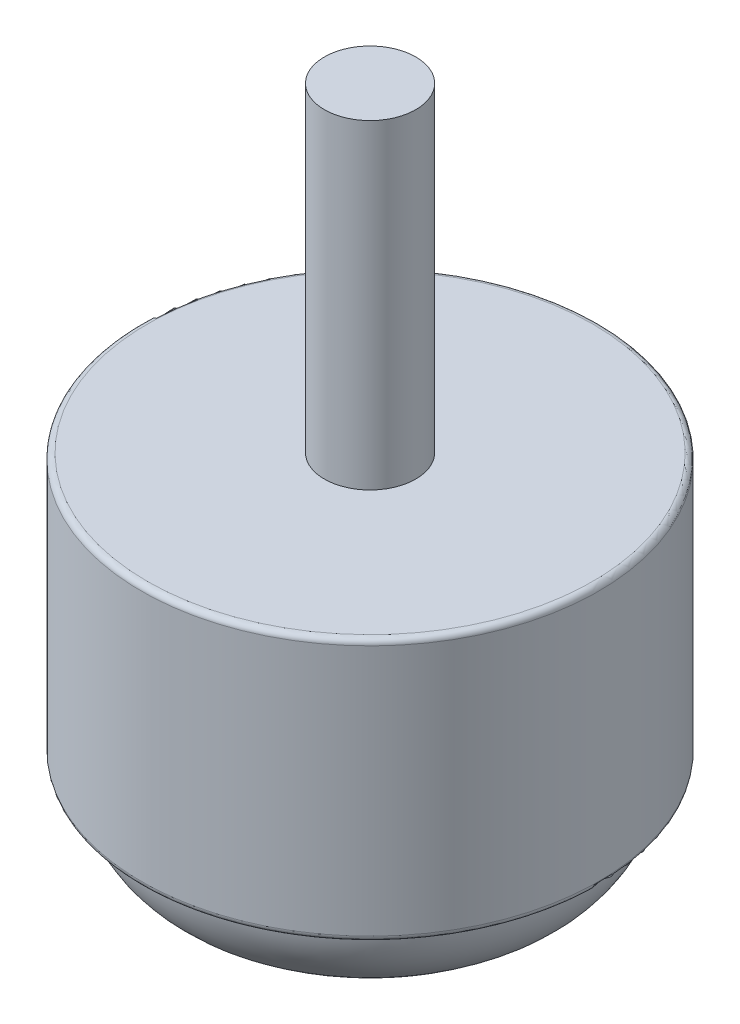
from build123d import *


with BuildPart() as part:
    # Esquisse1 → R_volution1 (revolve)
    with BuildSketch(Plane.XY, mode=Mode.PRIVATE) as r_volution1_sk:
        with BuildLine():
            Line((0, 64), (4, 64))
            Line((4, 64), (4, 36))
            Line((4, 36), (19.5, 36))
            ThreePointArc((19.5, 36), (19.853553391, 35.853553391), (20, 35.5))
            Line((20, 35.5), (20, 13.5))
            ThreePointArc((20, 13.5), (19.853553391, 13.146446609), (19.5, 13))
            Line((19.5, 13), (19.174512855, 13))
            ThreePointArc((19.174512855, 13), (18.508323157, 12.745782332), (18.180847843, 12.112382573))
            ThreePointArc((18.180847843, 12.112382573), (16.725383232, 8.453460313), (13.615175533, 6.038362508))
            ThreePointArc((13.615175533, 6.038362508), (13.521037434, 6.009684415), (13.423105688, 6))
            Line((13.423105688, 6), (10.677078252, 6))
            ThreePointArc((10.677078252, 6), (6.123724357, 1.602752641), (0, 0))
            Line((0, 0), (0, 64))
        make_face()
    revolve(r_volution1_sk.sketch.rotate(Axis((0, 0, 0), (0, 1, 0)), 90), axis=Axis((0, 0, 0), (0, 1, 0)))


solid = part.part
